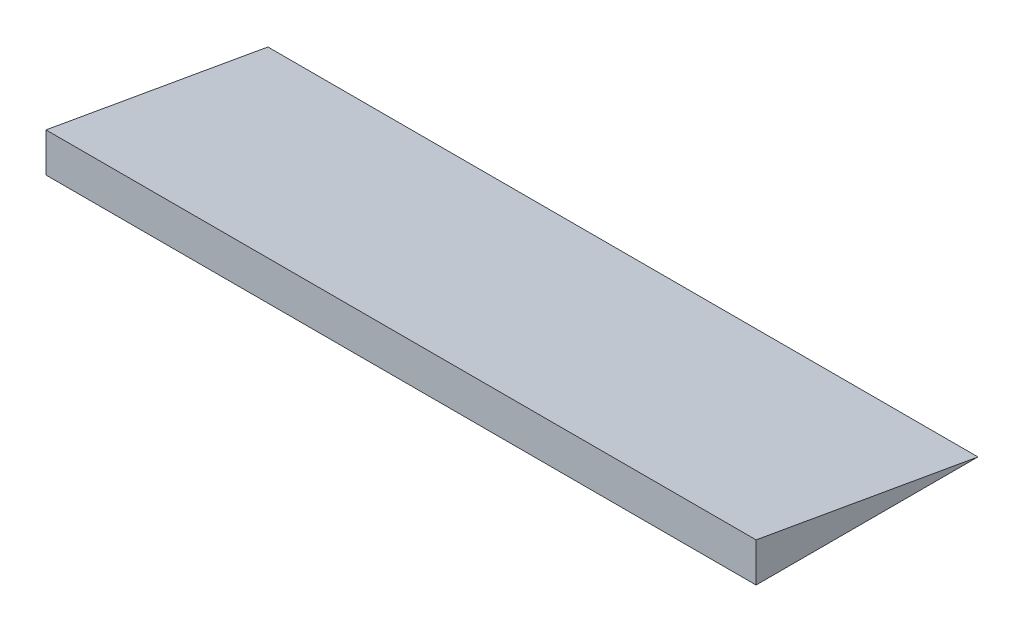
ISO-10303-21;
HEADER;
FILE_DESCRIPTION(('STEP AP214'),'2;1');
FILE_NAME('part.step','',(''),(''),'','','');
FILE_SCHEMA(('AUTOMOTIVE_DESIGN { 1 0 10303 214 1 1 1 1 }'));
ENDSEC;
DATA;
#1=APPLICATION_CONTEXT('core data for automotive mechanical design processes');
#2=APPLICATION_PROTOCOL_DEFINITION('international standard','automotive_design',2000,#1);
#3=PRODUCT_CONTEXT('',#1,'mechanical');
#4=PRODUCT('Part','Part','',(#3));
#5=PRODUCT_RELATED_PRODUCT_CATEGORY('part','',(#4));
#6=PRODUCT_DEFINITION_FORMATION('','',#4);
#7=PRODUCT_DEFINITION_CONTEXT('part definition',#1,'design');
#8=PRODUCT_DEFINITION('design','',#6,#7);
#9=PRODUCT_DEFINITION_SHAPE('','',#8);
#10=(LENGTH_UNIT() NAMED_UNIT(*) SI_UNIT(.MILLI.,.METRE.));
#11=(NAMED_UNIT(*) PLANE_ANGLE_UNIT() SI_UNIT($,.RADIAN.));
#12=(NAMED_UNIT(*) SI_UNIT($,.STERADIAN.) SOLID_ANGLE_UNIT());
#13=UNCERTAINTY_MEASURE_WITH_UNIT(LENGTH_MEASURE(1.E-05),#10,'distance_accuracy_value','');
#14=(GEOMETRIC_REPRESENTATION_CONTEXT(3) GLOBAL_UNCERTAINTY_ASSIGNED_CONTEXT((#13)) GLOBAL_UNIT_ASSIGNED_CONTEXT((#10,
#11,#12)) REPRESENTATION_CONTEXT('',''));
#15=CARTESIAN_POINT('',(0.,0.,0.));
#16=DIRECTION('',(0.,0.,1.));
#17=DIRECTION('',(1.,0.,0.));
#18=AXIS2_PLACEMENT_3D('',#15,#16,#17);
#19=CARTESIAN_POINT('',(1600.,0.,0.));
#20=DIRECTION('',(0.,0.,-1.));
#21=DIRECTION('',(-1.,0.,0.));
#22=AXIS2_PLACEMENT_3D('',#19,#20,#21);
#23=PLANE('',#22);
#24=DIRECTION('',(0.,-1.,0.));
#25=VECTOR('',#24,1.);
#26=CARTESIAN_POINT('',(0.,0.,0.));
#27=LINE('',#26,#25);
#28=CARTESIAN_POINT('',(0.,88.1634903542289,0.));
#29=VERTEX_POINT('',#28);
#30=CARTESIAN_POINT('',(0.,0.,0.));
#31=VERTEX_POINT('',#30);
#32=EDGE_CURVE('E80',#29,#31,#27,.T.);
#33=ORIENTED_EDGE('',*,*,#32,.T.);
#34=DIRECTION('',(-1.,0.,0.));
#35=VECTOR('',#34,1.);
#36=CARTESIAN_POINT('',(1600.,0.,0.));
#37=LINE('',#36,#35);
#38=CARTESIAN_POINT('',(1600.,0.,0.));
#39=VERTEX_POINT('',#38);
#40=EDGE_CURVE('E11',#39,#31,#37,.T.);
#41=ORIENTED_EDGE('',*,*,#40,.F.);
#42=DIRECTION('',(0.,-1.,0.));
#43=VECTOR('',#42,1.);
#44=CARTESIAN_POINT('',(1600.,0.,0.));
#45=LINE('',#44,#43);
#46=CARTESIAN_POINT('',(1600.,88.1634903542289,0.));
#47=VERTEX_POINT('',#46);
#48=EDGE_CURVE('E73',#47,#39,#45,.T.);
#49=ORIENTED_EDGE('',*,*,#48,.F.);
#50=DIRECTION('',(-1.,0.,0.));
#51=VECTOR('',#50,1.);
#52=CARTESIAN_POINT('',(1600.,88.1634903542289,0.));
#53=LINE('',#52,#51);
#54=EDGE_CURVE('E81',#47,#29,#53,.T.);
#55=ORIENTED_EDGE('',*,*,#54,.T.);
#56=EDGE_LOOP('',(#33,#41,#49,#55));
#57=FACE_BOUND('',#56,.T.);
#58=ADVANCED_FACE('F33',(#57),#23,.F.);
#59=CARTESIAN_POINT('',(1600.,0.,0.));
#60=DIRECTION('',(0.,1.,0.));
#61=DIRECTION('',(0.,0.,1.));
#62=AXIS2_PLACEMENT_3D('',#59,#60,#61);
#63=PLANE('',#62);
#64=CARTESIAN_POINT('',(1050.,0.,-250.));
#65=DIRECTION('',(0.,-1.,0.));
#66=DIRECTION('',(0.,0.,1.));
#67=AXIS2_PLACEMENT_3D('',#64,#65,#66);
#68=CIRCLE('',#67,5.00000000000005);
#69=CARTESIAN_POINT('',(1050.,0.,-245.));
#70=VERTEX_POINT('',#69);
#71=EDGE_CURVE('E117',#70,#70,#68,.T.);
#72=ORIENTED_EDGE('',*,*,#71,.F.);
#73=EDGE_LOOP('',(#72));
#74=FACE_BOUND('',#73,.T.);
#75=CARTESIAN_POINT('',(550.,0.,-250.));
#76=DIRECTION('',(0.,-1.,0.));
#77=DIRECTION('',(0.,0.,-1.));
#78=AXIS2_PLACEMENT_3D('',#75,#76,#77);
#79=CIRCLE('',#78,5.00000000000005);
#80=CARTESIAN_POINT('',(550.,0.,-255.));
#81=VERTEX_POINT('',#80);
#82=EDGE_CURVE('E87',#81,#81,#79,.T.);
#83=ORIENTED_EDGE('',*,*,#82,.F.);
#84=EDGE_LOOP('',(#83));
#85=FACE_BOUND('',#84,.T.);
#86=DIRECTION('',(0.,0.,-1.));
#87=VECTOR('',#86,1.);
#88=CARTESIAN_POINT('',(0.,0.,0.));
#89=LINE('',#88,#87);
#90=CARTESIAN_POINT('',(0.,0.,-500.));
#91=VERTEX_POINT('',#90);
#92=EDGE_CURVE('E61',#31,#91,#89,.T.);
#93=ORIENTED_EDGE('',*,*,#92,.T.);
#94=DIRECTION('',(-1.,0.,0.));
#95=VECTOR('',#94,1.);
#96=CARTESIAN_POINT('',(1600.,0.,-500.));
#97=LINE('',#96,#95);
#98=CARTESIAN_POINT('',(1600.,0.,-500.));
#99=VERTEX_POINT('',#98);
#100=EDGE_CURVE('E41',#99,#91,#97,.T.);
#101=ORIENTED_EDGE('',*,*,#100,.F.);
#102=DIRECTION('',(0.,0.,-1.));
#103=VECTOR('',#102,1.);
#104=CARTESIAN_POINT('',(1600.,0.,0.));
#105=LINE('',#104,#103);
#106=EDGE_CURVE('E69',#39,#99,#105,.T.);
#107=ORIENTED_EDGE('',*,*,#106,.F.);
#108=ORIENTED_EDGE('',*,*,#40,.T.);
#109=EDGE_LOOP('',(#93,#101,#107,#108));
#110=FACE_BOUND('',#109,.T.);
#111=ADVANCED_FACE('F70',(#74,#85,#110),#63,.F.);
#112=CARTESIAN_POINT('',(1600.,0.,-500.));
#113=DIRECTION('',(0.,-0.984807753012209,0.173648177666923));
#114=DIRECTION('',(0.,-0.173648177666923,-0.984807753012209));
#115=AXIS2_PLACEMENT_3D('',#112,#113,#114);
#116=PLANE('',#115);
#117=DIRECTION('',(0.,0.173648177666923,0.984807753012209));
#118=VECTOR('',#117,1.);
#119=CARTESIAN_POINT('',(0.,0.,-500.));
#120=LINE('',#119,#118);
#121=EDGE_CURVE('E66',#91,#29,#120,.T.);
#122=ORIENTED_EDGE('',*,*,#121,.T.);
#123=ORIENTED_EDGE('',*,*,#54,.F.);
#124=DIRECTION('',(0.,0.173648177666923,0.984807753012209));
#125=VECTOR('',#124,1.);
#126=CARTESIAN_POINT('',(1600.,0.,-500.));
#127=LINE('',#126,#125);
#128=EDGE_CURVE('E49',#99,#47,#127,.T.);
#129=ORIENTED_EDGE('',*,*,#128,.F.);
#130=ORIENTED_EDGE('',*,*,#100,.T.);
#131=EDGE_LOOP('',(#122,#123,#129,#130));
#132=FACE_BOUND('',#131,.T.);
#133=ADVANCED_FACE('F92',(#132),#116,.F.);
#134=CARTESIAN_POINT('',(1600.,0.,0.));
#135=DIRECTION('',(-1.,0.,0.));
#136=DIRECTION('',(0.,0.,1.));
#137=AXIS2_PLACEMENT_3D('',#134,#135,#136);
#138=PLANE('',#137);
#139=ORIENTED_EDGE('',*,*,#48,.T.);
#140=ORIENTED_EDGE('',*,*,#106,.T.);
#141=ORIENTED_EDGE('',*,*,#128,.T.);
#142=EDGE_LOOP('',(#139,#140,#141));
#143=FACE_BOUND('',#142,.T.);
#144=ADVANCED_FACE('F76',(#143),#138,.F.);
#145=CARTESIAN_POINT('',(0.,0.,0.));
#146=DIRECTION('',(-1.,0.,0.));
#147=DIRECTION('',(0.,0.,1.));
#148=AXIS2_PLACEMENT_3D('',#145,#146,#147);
#149=PLANE('',#148);
#150=ORIENTED_EDGE('',*,*,#32,.F.);
#151=ORIENTED_EDGE('',*,*,#121,.F.);
#152=ORIENTED_EDGE('',*,*,#92,.F.);
#153=EDGE_LOOP('',(#150,#151,#152));
#154=FACE_BOUND('',#153,.T.);
#155=ADVANCED_FACE('F93',(#154),#149,.T.);
#156=CARTESIAN_POINT('',(550.,10.,-250.));
#157=DIRECTION('',(0.,-1.,0.));
#158=DIRECTION('',(0.,0.,-1.));
#159=AXIS2_PLACEMENT_3D('',#156,#157,#158);
#160=CYLINDRICAL_SURFACE('',#159,5.00000000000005);
#161=CARTESIAN_POINT('',(550.,10.,-250.));
#162=DIRECTION('',(0.,-1.,0.));
#163=DIRECTION('',(0.,0.,-1.));
#164=AXIS2_PLACEMENT_3D('',#161,#162,#163);
#165=CIRCLE('',#164,5.00000000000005);
#166=CARTESIAN_POINT('',(550.,10.,-255.));
#167=VERTEX_POINT('',#166);
#168=EDGE_CURVE('E83',#167,#167,#165,.T.);
#169=ORIENTED_EDGE('',*,*,#168,.F.);
#170=EDGE_LOOP('',(#169));
#171=FACE_BOUND('',#170,.T.);
#172=ORIENTED_EDGE('',*,*,#82,.T.);
#173=EDGE_LOOP('',(#172));
#174=FACE_BOUND('',#173,.T.);
#175=ADVANCED_FACE('F95',(#171,#174),#160,.F.);
#176=CARTESIAN_POINT('',(550.,10.,-250.));
#177=DIRECTION('',(0.,-1.,0.));
#178=DIRECTION('',(0.,0.,-1.));
#179=AXIS2_PLACEMENT_3D('',#176,#177,#178);
#180=PLANE('',#179);
#181=ORIENTED_EDGE('',*,*,#168,.T.);
#182=EDGE_LOOP('',(#181));
#183=FACE_BOUND('',#182,.T.);
#184=ADVANCED_FACE('F101',(#183),#180,.T.);
#185=CARTESIAN_POINT('',(1050.,10.,-250.));
#186=DIRECTION('',(0.,-1.,0.));
#187=DIRECTION('',(0.,0.,-1.));
#188=AXIS2_PLACEMENT_3D('',#185,#186,#187);
#189=CYLINDRICAL_SURFACE('',#188,5.00000000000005);
#190=CARTESIAN_POINT('',(1050.,10.,-250.));
#191=DIRECTION('',(0.,-1.,0.));
#192=DIRECTION('',(0.,0.,1.));
#193=AXIS2_PLACEMENT_3D('',#190,#191,#192);
#194=CIRCLE('',#193,5.00000000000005);
#195=CARTESIAN_POINT('',(1050.,10.,-245.));
#196=VERTEX_POINT('',#195);
#197=EDGE_CURVE('E121',#196,#196,#194,.T.);
#198=ORIENTED_EDGE('',*,*,#197,.F.);
#199=EDGE_LOOP('',(#198));
#200=FACE_BOUND('',#199,.T.);
#201=ORIENTED_EDGE('',*,*,#71,.T.);
#202=EDGE_LOOP('',(#201));
#203=FACE_BOUND('',#202,.T.);
#204=ADVANCED_FACE('F127',(#200,#203),#189,.F.);
#205=CARTESIAN_POINT('',(1050.,10.,-250.));
#206=DIRECTION('',(0.,1.,0.));
#207=DIRECTION('',(0.,0.,1.));
#208=AXIS2_PLACEMENT_3D('',#205,#206,#207);
#209=PLANE('',#208);
#210=ORIENTED_EDGE('',*,*,#197,.T.);
#211=EDGE_LOOP('',(#210));
#212=FACE_BOUND('',#211,.T.);
#213=ADVANCED_FACE('F129',(#212),#209,.F.);
#214=CLOSED_SHELL('',(#58,#111,#133,#144,#155,#175,#184,#204,#213));
#215=MANIFOLD_SOLID_BREP('B2',#214);
#216=ADVANCED_BREP_SHAPE_REPRESENTATION('',(#18,#215),#14);
#217=SHAPE_DEFINITION_REPRESENTATION(#9,#216);
ENDSEC;
END-ISO-10303-21;
